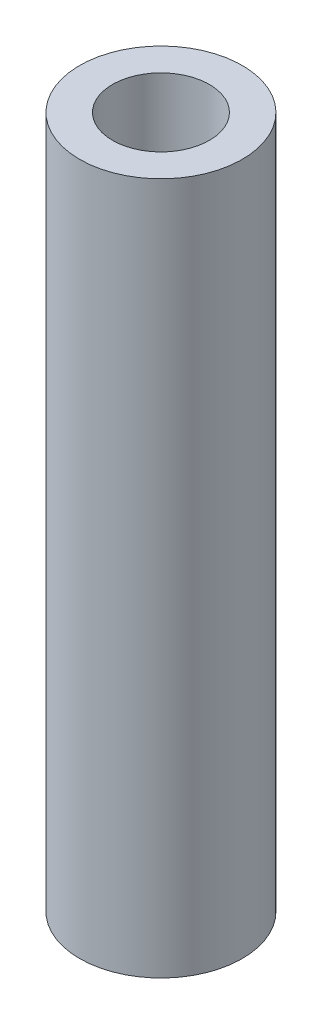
ISO-10303-21;
HEADER;
FILE_DESCRIPTION(('STEP AP214'),'2;1');
FILE_NAME('part.step','',(''),(''),'','','');
FILE_SCHEMA(('AUTOMOTIVE_DESIGN { 1 0 10303 214 1 1 1 1 }'));
ENDSEC;
DATA;
#1=APPLICATION_CONTEXT('core data for automotive mechanical design processes');
#2=APPLICATION_PROTOCOL_DEFINITION('international standard','automotive_design',2000,#1);
#3=PRODUCT_CONTEXT('',#1,'mechanical');
#4=PRODUCT('Part','Part','',(#3));
#5=PRODUCT_RELATED_PRODUCT_CATEGORY('part','',(#4));
#6=PRODUCT_DEFINITION_FORMATION('','',#4);
#7=PRODUCT_DEFINITION_CONTEXT('part definition',#1,'design');
#8=PRODUCT_DEFINITION('design','',#6,#7);
#9=PRODUCT_DEFINITION_SHAPE('','',#8);
#10=(LENGTH_UNIT() NAMED_UNIT(*) SI_UNIT(.MILLI.,.METRE.));
#11=(NAMED_UNIT(*) PLANE_ANGLE_UNIT() SI_UNIT($,.RADIAN.));
#12=(NAMED_UNIT(*) SI_UNIT($,.STERADIAN.) SOLID_ANGLE_UNIT());
#13=UNCERTAINTY_MEASURE_WITH_UNIT(LENGTH_MEASURE(1.E-05),#10,'distance_accuracy_value','');
#14=(GEOMETRIC_REPRESENTATION_CONTEXT(3) GLOBAL_UNCERTAINTY_ASSIGNED_CONTEXT((#13)) GLOBAL_UNIT_ASSIGNED_CONTEXT((#10,
#11,#12)) REPRESENTATION_CONTEXT('',''));
#15=CARTESIAN_POINT('',(0.,0.,0.));
#16=DIRECTION('',(0.,0.,1.));
#17=DIRECTION('',(1.,0.,0.));
#18=AXIS2_PLACEMENT_3D('',#15,#16,#17);
#19=CARTESIAN_POINT('',(0.,20.32,0.));
#20=DIRECTION('',(0.,-1.,0.));
#21=DIRECTION('',(0.,0.,-1.));
#22=AXIS2_PLACEMENT_3D('',#19,#20,#21);
#23=CYLINDRICAL_SURFACE('',#22,2.3876);
#24=CARTESIAN_POINT('',(0.,20.32,0.));
#25=DIRECTION('',(0.,1.,0.));
#26=DIRECTION('',(0.,0.,1.));
#27=AXIS2_PLACEMENT_3D('',#24,#25,#26);
#28=CIRCLE('',#27,2.3876);
#29=CARTESIAN_POINT('',(0.,20.32,2.3876));
#30=VERTEX_POINT('',#29);
#31=EDGE_CURVE('E11',#30,#30,#28,.T.);
#32=ORIENTED_EDGE('',*,*,#31,.F.);
#33=EDGE_LOOP('',(#32));
#34=FACE_BOUND('',#33,.T.);
#35=CARTESIAN_POINT('',(0.,0.,0.));
#36=DIRECTION('',(0.,1.,0.));
#37=DIRECTION('',(0.,0.,1.));
#38=AXIS2_PLACEMENT_3D('',#35,#36,#37);
#39=CIRCLE('',#38,2.3876);
#40=CARTESIAN_POINT('',(0.,0.,2.3876));
#41=VERTEX_POINT('',#40);
#42=EDGE_CURVE('E36',#41,#41,#39,.T.);
#43=ORIENTED_EDGE('',*,*,#42,.T.);
#44=EDGE_LOOP('',(#43));
#45=FACE_BOUND('',#44,.T.);
#46=ADVANCED_FACE('F30',(#34,#45),#23,.T.);
#47=CARTESIAN_POINT('',(0.,20.32,0.));
#48=DIRECTION('',(0.,1.,0.));
#49=DIRECTION('',(0.,0.,1.));
#50=AXIS2_PLACEMENT_3D('',#47,#48,#49);
#51=PLANE('',#50);
#52=CARTESIAN_POINT('',(0.,20.32,0.));
#53=DIRECTION('',(0.,1.,0.));
#54=DIRECTION('',(0.,0.,1.));
#55=AXIS2_PLACEMENT_3D('',#52,#53,#54);
#56=CIRCLE('',#55,1.4224);
#57=CARTESIAN_POINT('',(0.,20.32,1.4224));
#58=VERTEX_POINT('',#57);
#59=EDGE_CURVE('E56',#58,#58,#56,.T.);
#60=ORIENTED_EDGE('',*,*,#59,.F.);
#61=EDGE_LOOP('',(#60));
#62=FACE_BOUND('',#61,.T.);
#63=ORIENTED_EDGE('',*,*,#31,.T.);
#64=EDGE_LOOP('',(#63));
#65=FACE_BOUND('',#64,.T.);
#66=ADVANCED_FACE('F65',(#62,#65),#51,.T.);
#67=CARTESIAN_POINT('',(0.,0.,0.));
#68=DIRECTION('',(0.,1.,0.));
#69=DIRECTION('',(0.,0.,1.));
#70=AXIS2_PLACEMENT_3D('',#67,#68,#69);
#71=PLANE('',#70);
#72=ORIENTED_EDGE('',*,*,#42,.F.);
#73=EDGE_LOOP('',(#72));
#74=FACE_BOUND('',#73,.T.);
#75=ADVANCED_FACE('F62',(#74),#71,.F.);
#76=CARTESIAN_POINT('',(0.,20.32,0.));
#77=DIRECTION('',(0.,1.,0.));
#78=DIRECTION('',(0.,0.,1.));
#79=AXIS2_PLACEMENT_3D('',#76,#77,#78);
#80=CYLINDRICAL_SURFACE('',#79,1.4224);
#81=CARTESIAN_POINT('',(0.,10.668,0.));
#82=DIRECTION('',(0.,1.,0.));
#83=DIRECTION('',(0.,0.,1.));
#84=AXIS2_PLACEMENT_3D('',#81,#82,#83);
#85=CIRCLE('',#84,1.4224);
#86=CARTESIAN_POINT('',(0.,10.668,1.4224));
#87=VERTEX_POINT('',#86);
#88=EDGE_CURVE('E51',#87,#87,#85,.T.);
#89=ORIENTED_EDGE('',*,*,#88,.F.);
#90=EDGE_LOOP('',(#89));
#91=FACE_BOUND('',#90,.T.);
#92=ORIENTED_EDGE('',*,*,#59,.T.);
#93=EDGE_LOOP('',(#92));
#94=FACE_BOUND('',#93,.T.);
#95=ADVANCED_FACE('F64',(#91,#94),#80,.F.);
#96=CARTESIAN_POINT('',(1.1303,10.668,0.));
#97=DIRECTION('',(0.,-1.,0.));
#98=DIRECTION('',(0.,0.,-1.));
#99=AXIS2_PLACEMENT_3D('',#96,#97,#98);
#100=PLANE('',#99);
#101=CARTESIAN_POINT('',(0.,10.668,0.));
#102=DIRECTION('',(0.,1.,0.));
#103=DIRECTION('',(0.,0.,1.));
#104=AXIS2_PLACEMENT_3D('',#101,#102,#103);
#105=CIRCLE('',#104,1.1303);
#106=CARTESIAN_POINT('',(0.,10.668,1.1303));
#107=VERTEX_POINT('',#106);
#108=EDGE_CURVE('E48',#107,#107,#105,.T.);
#109=ORIENTED_EDGE('',*,*,#108,.F.);
#110=EDGE_LOOP('',(#109));
#111=FACE_BOUND('',#110,.T.);
#112=ORIENTED_EDGE('',*,*,#88,.T.);
#113=EDGE_LOOP('',(#112));
#114=FACE_BOUND('',#113,.T.);
#115=ADVANCED_FACE('F71',(#111,#114),#100,.F.);
#116=CARTESIAN_POINT('',(0.,20.32,0.));
#117=DIRECTION('',(0.,1.,0.));
#118=DIRECTION('',(0.,0.,1.));
#119=AXIS2_PLACEMENT_3D('',#116,#117,#118);
#120=CYLINDRICAL_SURFACE('',#119,1.1303);
#121=CARTESIAN_POINT('',(0.,7.366,0.));
#122=DIRECTION('',(0.,1.,0.));
#123=DIRECTION('',(0.,0.,1.));
#124=AXIS2_PLACEMENT_3D('',#121,#122,#123);
#125=CIRCLE('',#124,1.1303);
#126=CARTESIAN_POINT('',(0.,7.366,1.1303));
#127=VERTEX_POINT('',#126);
#128=EDGE_CURVE('E46',#127,#127,#125,.T.);
#129=ORIENTED_EDGE('',*,*,#128,.F.);
#130=EDGE_LOOP('',(#129));
#131=FACE_BOUND('',#130,.T.);
#132=ORIENTED_EDGE('',*,*,#108,.T.);
#133=EDGE_LOOP('',(#132));
#134=FACE_BOUND('',#133,.T.);
#135=ADVANCED_FACE('F42',(#131,#134),#120,.F.);
#136=CARTESIAN_POINT('',(0.,7.366,0.));
#137=DIRECTION('',(0.,1.,0.));
#138=DIRECTION('',(0.,0.,1.));
#139=AXIS2_PLACEMENT_3D('',#136,#137,#138);
#140=CONICAL_SURFACE('',#139,1.1303,1.02974425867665);
#141=CARTESIAN_POINT('',(0.,6.68684724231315,0.));
#142=VERTEX_POINT('',#141);
#143=VERTEX_LOOP('',#142);
#144=FACE_BOUND('',#143,.T.);
#145=ORIENTED_EDGE('',*,*,#128,.T.);
#146=EDGE_LOOP('',(#145));
#147=FACE_BOUND('',#146,.T.);
#148=ADVANCED_FACE('F39',(#144,#147),#140,.F.);
#149=CLOSED_SHELL('',(#46,#66,#75,#95,#115,#135,#148));
#150=MANIFOLD_SOLID_BREP('B2',#149);
#151=ADVANCED_BREP_SHAPE_REPRESENTATION('',(#18,#150),#14);
#152=SHAPE_DEFINITION_REPRESENTATION(#9,#151);
ENDSEC;
END-ISO-10303-21;
